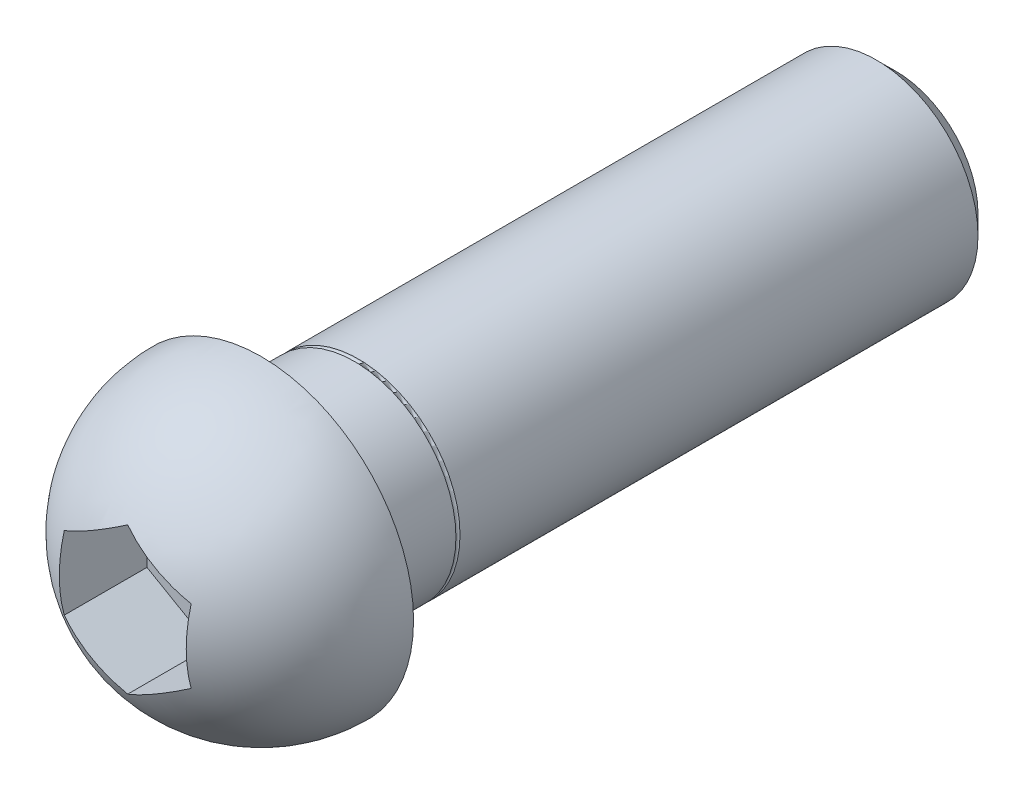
ISO-10303-21;
HEADER;
FILE_DESCRIPTION(('STEP AP214'),'2;1');
FILE_NAME('part.step','',(''),(''),'','','');
FILE_SCHEMA(('AUTOMOTIVE_DESIGN { 1 0 10303 214 1 1 1 1 }'));
ENDSEC;
DATA;
#1=APPLICATION_CONTEXT('core data for automotive mechanical design processes');
#2=APPLICATION_PROTOCOL_DEFINITION('international standard','automotive_design',2000,#1);
#3=PRODUCT_CONTEXT('',#1,'mechanical');
#4=PRODUCT('Part','Part','',(#3));
#5=PRODUCT_RELATED_PRODUCT_CATEGORY('part','',(#4));
#6=PRODUCT_DEFINITION_FORMATION('','',#4);
#7=PRODUCT_DEFINITION_CONTEXT('part definition',#1,'design');
#8=PRODUCT_DEFINITION('design','',#6,#7);
#9=PRODUCT_DEFINITION_SHAPE('','',#8);
#10=(LENGTH_UNIT() NAMED_UNIT(*) SI_UNIT(.MILLI.,.METRE.));
#11=(NAMED_UNIT(*) PLANE_ANGLE_UNIT() SI_UNIT($,.RADIAN.));
#12=(NAMED_UNIT(*) SI_UNIT($,.STERADIAN.) SOLID_ANGLE_UNIT());
#13=UNCERTAINTY_MEASURE_WITH_UNIT(LENGTH_MEASURE(1.E-05),#10,'distance_accuracy_value','');
#14=(GEOMETRIC_REPRESENTATION_CONTEXT(3) GLOBAL_UNCERTAINTY_ASSIGNED_CONTEXT((#13)) GLOBAL_UNIT_ASSIGNED_CONTEXT((#10,
#11,#12)) REPRESENTATION_CONTEXT('',''));
#15=CARTESIAN_POINT('',(0.,0.,0.));
#16=DIRECTION('',(0.,0.,1.));
#17=DIRECTION('',(1.,0.,0.));
#18=AXIS2_PLACEMENT_3D('',#15,#16,#17);
#19=CARTESIAN_POINT('',(0.,0.,8.5));
#20=DIRECTION('',(0.,0.,-1.));
#21=DIRECTION('',(-1.,0.,0.));
#22=AXIS2_PLACEMENT_3D('',#19,#20,#21);
#23=PLANE('',#22);
#24=DIRECTION('',(-0.866025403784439,0.5,0.));
#25=VECTOR('',#24,1.);
#26=CARTESIAN_POINT('',(2.5,1.44337567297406,8.5));
#27=LINE('',#26,#25);
#28=CARTESIAN_POINT('',(2.5,1.44337567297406,8.5));
#29=VERTEX_POINT('',#28);
#30=CARTESIAN_POINT('',(0.,2.88675134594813,8.5));
#31=VERTEX_POINT('',#30);
#32=EDGE_CURVE('E68',#29,#31,#27,.T.);
#33=ORIENTED_EDGE('',*,*,#32,.T.);
#34=DIRECTION('',(-0.866025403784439,-0.5,0.));
#35=VECTOR('',#34,1.);
#36=CARTESIAN_POINT('',(0.,2.88675134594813,8.5));
#37=LINE('',#36,#35);
#38=CARTESIAN_POINT('',(-2.5,1.44337567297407,8.5));
#39=VERTEX_POINT('',#38);
#40=EDGE_CURVE('E103',#31,#39,#37,.T.);
#41=ORIENTED_EDGE('',*,*,#40,.T.);
#42=DIRECTION('',(0.,1.,0.));
#43=VECTOR('',#42,1.);
#44=CARTESIAN_POINT('',(-2.5,1.44337567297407,8.5));
#45=LINE('',#44,#43);
#46=CARTESIAN_POINT('',(-2.5,-1.44337567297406,8.5));
#47=VERTEX_POINT('',#46);
#48=EDGE_CURVE('E109',#39,#47,#45,.F.);
#49=ORIENTED_EDGE('',*,*,#48,.T.);
#50=DIRECTION('',(0.866025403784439,-0.5,0.));
#51=VECTOR('',#50,1.);
#52=CARTESIAN_POINT('',(-2.5,-1.44337567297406,8.5));
#53=LINE('',#52,#51);
#54=CARTESIAN_POINT('',(0.,-2.88675134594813,8.5));
#55=VERTEX_POINT('',#54);
#56=EDGE_CURVE('E80',#47,#55,#53,.T.);
#57=ORIENTED_EDGE('',*,*,#56,.T.);
#58=DIRECTION('',(0.866025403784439,0.5,0.));
#59=VECTOR('',#58,1.);
#60=CARTESIAN_POINT('',(0.,-2.88675134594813,8.5));
#61=LINE('',#60,#59);
#62=CARTESIAN_POINT('',(2.5,-1.44337567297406,8.5));
#63=VERTEX_POINT('',#62);
#64=EDGE_CURVE('E82',#55,#63,#61,.T.);
#65=ORIENTED_EDGE('',*,*,#64,.T.);
#66=DIRECTION('',(0.,1.,0.));
#67=VECTOR('',#66,1.);
#68=CARTESIAN_POINT('',(2.5,0.,8.5));
#69=LINE('',#68,#67);
#70=EDGE_CURVE('E84',#63,#29,#69,.T.);
#71=ORIENTED_EDGE('',*,*,#70,.T.);
#72=EDGE_LOOP('',(#33,#41,#49,#57,#65,#71));
#73=FACE_BOUND('',#72,.T.);
#74=ADVANCED_FACE('F15',(#73),#23,.F.);
#75=CARTESIAN_POINT('',(2.5,0.,14.5));
#76=DIRECTION('',(1.,0.,0.));
#77=DIRECTION('',(0.,0.,-1.));
#78=AXIS2_PLACEMENT_3D('',#75,#76,#77);
#79=PLANE('',#78);
#80=DIRECTION('',(0.,0.,1.));
#81=VECTOR('',#80,1.);
#82=CARTESIAN_POINT('',(2.5,1.44337567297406,14.5));
#83=LINE('',#82,#81);
#84=CARTESIAN_POINT('',(2.5,1.44337567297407,11.7599112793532));
#85=VERTEX_POINT('',#84);
#86=EDGE_CURVE('E92',#85,#29,#83,.F.);
#87=ORIENTED_EDGE('',*,*,#86,.T.);
#88=ORIENTED_EDGE('',*,*,#70,.F.);
#89=DIRECTION('',(0.,0.,1.));
#90=VECTOR('',#89,1.);
#91=CARTESIAN_POINT('',(2.5,-1.44337567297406,14.5));
#92=LINE('',#91,#90);
#93=CARTESIAN_POINT('',(2.5,-1.44337567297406,11.7599112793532));
#94=VERTEX_POINT('',#93);
#95=EDGE_CURVE('E88',#63,#94,#92,.T.);
#96=ORIENTED_EDGE('',*,*,#95,.T.);
#97=CARTESIAN_POINT('',(2.5,0.,6.5));
#98=DIRECTION('',(1.,0.,0.));
#99=DIRECTION('',(0.,0.,-1.));
#100=AXIS2_PLACEMENT_3D('',#97,#98,#99);
#101=CIRCLE('',#100,5.45435605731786);
#102=EDGE_CURVE('E18',#85,#94,#101,.T.);
#103=ORIENTED_EDGE('',*,*,#102,.F.);
#104=EDGE_LOOP('',(#87,#88,#96,#103));
#105=FACE_BOUND('',#104,.T.);
#106=ADVANCED_FACE('F90',(#105),#79,.F.);
#107=CARTESIAN_POINT('',(0.,-2.88675134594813,14.5));
#108=DIRECTION('',(0.5,-0.866025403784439,0.));
#109=DIRECTION('',(0.866025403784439,0.5,0.));
#110=AXIS2_PLACEMENT_3D('',#107,#108,#109);
#111=PLANE('',#110);
#112=ORIENTED_EDGE('',*,*,#95,.F.);
#113=ORIENTED_EDGE('',*,*,#64,.F.);
#114=DIRECTION('',(0.,0.,1.));
#115=VECTOR('',#114,1.);
#116=CARTESIAN_POINT('',(0.,-2.88675134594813,14.5));
#117=LINE('',#116,#115);
#118=CARTESIAN_POINT('',(0.,-2.88675134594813,11.7599112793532));
#119=VERTEX_POINT('',#118);
#120=EDGE_CURVE('E98',#55,#119,#117,.T.);
#121=ORIENTED_EDGE('',*,*,#120,.T.);
#122=CARTESIAN_POINT('',(2.5,-1.44337567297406,11.7599112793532));
#123=CARTESIAN_POINT('',(2.37052455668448,-1.51812835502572,11.8009548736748));
#124=CARTESIAN_POINT('',(2.23952785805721,-1.59375933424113,11.8355910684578));
#125=CARTESIAN_POINT('',(1.97542390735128,-1.74623982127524,11.8918777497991));
#126=CARTESIAN_POINT('',(1.84231612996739,-1.82308963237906,11.9135249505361));
#127=CARTESIAN_POINT('',(1.57792949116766,-1.97573332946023,11.9433104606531));
#128=CARTESIAN_POINT('',(1.44667483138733,-2.0515132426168,11.95173553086));
#129=CARTESIAN_POINT('',(1.18406784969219,-2.20312945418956,11.9559318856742));
#130=CARTESIAN_POINT('',(1.05271558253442,-2.27896572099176,11.9517078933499));
#131=CARTESIAN_POINT('',(0.767059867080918,-2.44388912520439,11.9287241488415));
#132=CARTESIAN_POINT('',(0.612902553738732,-2.53289189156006,11.9074733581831));
#133=CARTESIAN_POINT('',(0.305108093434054,-2.71059710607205,11.8472041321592));
#134=CARTESIAN_POINT('',(0.151505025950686,-2.79927987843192,11.8079535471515));
#135=CARTESIAN_POINT('',(0.,-2.88675134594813,11.7599112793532));
#136=B_SPLINE_CURVE_WITH_KNOTS('',3,(#122,#123,#124,#125,#126,#127,#128,#129,#130,#131,#132,
#133,#134,#135),.UNSPECIFIED.,.F.,.F.,(4,2,2,2,2,2,4),(0.,0.464967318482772,0.930052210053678,
1.38490366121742,1.83958529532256,2.37651005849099,2.92056340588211),.UNSPECIFIED.);
#137=EDGE_CURVE('E96',#94,#119,#136,.T.);
#138=ORIENTED_EDGE('',*,*,#137,.F.);
#139=EDGE_LOOP('',(#112,#113,#121,#138));
#140=FACE_BOUND('',#139,.T.);
#141=ADVANCED_FACE('F94',(#140),#111,.F.);
#142=CARTESIAN_POINT('',(-2.5,-1.44337567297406,14.5));
#143=DIRECTION('',(-0.5,-0.866025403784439,0.));
#144=DIRECTION('',(0.866025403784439,-0.5,0.));
#145=AXIS2_PLACEMENT_3D('',#142,#143,#144);
#146=PLANE('',#145);
#147=ORIENTED_EDGE('',*,*,#120,.F.);
#148=ORIENTED_EDGE('',*,*,#56,.F.);
#149=DIRECTION('',(0.,0.,1.));
#150=VECTOR('',#149,1.);
#151=CARTESIAN_POINT('',(-2.5,-1.44337567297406,14.5));
#152=LINE('',#151,#150);
#153=CARTESIAN_POINT('',(-2.5,-1.44337567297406,11.7599112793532));
#154=VERTEX_POINT('',#153);
#155=EDGE_CURVE('E106',#47,#154,#152,.T.);
#156=ORIENTED_EDGE('',*,*,#155,.T.);
#157=CARTESIAN_POINT('',(0.,-2.88675134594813,11.7599112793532));
#158=CARTESIAN_POINT('',(-0.129475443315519,-2.81199866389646,11.8009548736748));
#159=CARTESIAN_POINT('',(-0.260472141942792,-2.73636768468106,11.8355910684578));
#160=CARTESIAN_POINT('',(-0.524576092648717,-2.58388719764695,11.8918777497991));
#161=CARTESIAN_POINT('',(-0.657683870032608,-2.50703738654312,11.9135249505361));
#162=CARTESIAN_POINT('',(-0.922070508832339,-2.35439368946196,11.9433104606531));
#163=CARTESIAN_POINT('',(-1.05332516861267,-2.27861377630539,11.95173553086));
#164=CARTESIAN_POINT('',(-1.3159321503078,-2.12699756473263,11.9559318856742));
#165=CARTESIAN_POINT('',(-1.44728441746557,-2.05116129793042,11.9517078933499));
#166=CARTESIAN_POINT('',(-1.73294013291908,-1.88623789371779,11.9287241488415));
#167=CARTESIAN_POINT('',(-1.88709744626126,-1.79723512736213,11.9074733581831));
#168=CARTESIAN_POINT('',(-2.19489190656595,-1.61952991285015,11.8472041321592));
#169=CARTESIAN_POINT('',(-2.34849497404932,-1.53084714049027,11.8079535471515));
#170=CARTESIAN_POINT('',(-2.5,-1.44337567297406,11.7599112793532));
#171=B_SPLINE_CURVE_WITH_KNOTS('',3,(#157,#158,#159,#160,#161,#162,#163,#164,#165,#166,#167,
#168,#169,#170),.UNSPECIFIED.,.F.,.F.,(4,2,2,2,2,2,4),(0.,0.464967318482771,0.930052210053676,
1.38490366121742,1.83958529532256,2.37651005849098,2.92056340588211),.UNSPECIFIED.);
#172=EDGE_CURVE('E159',#119,#154,#171,.T.);
#173=ORIENTED_EDGE('',*,*,#172,.F.);
#174=EDGE_LOOP('',(#147,#148,#156,#173));
#175=FACE_BOUND('',#174,.T.);
#176=ADVANCED_FACE('F157',(#175),#146,.F.);
#177=CARTESIAN_POINT('',(-2.5,1.44337567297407,14.5));
#178=DIRECTION('',(-1.,0.,0.));
#179=DIRECTION('',(0.,0.,1.));
#180=AXIS2_PLACEMENT_3D('',#177,#178,#179);
#181=PLANE('',#180);
#182=ORIENTED_EDGE('',*,*,#155,.F.);
#183=ORIENTED_EDGE('',*,*,#48,.F.);
#184=DIRECTION('',(0.,0.,1.));
#185=VECTOR('',#184,1.);
#186=CARTESIAN_POINT('',(-2.5,1.44337567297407,14.5));
#187=LINE('',#186,#185);
#188=CARTESIAN_POINT('',(-2.5,1.44337567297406,11.7599112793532));
#189=VERTEX_POINT('',#188);
#190=EDGE_CURVE('E105',#39,#189,#187,.T.);
#191=ORIENTED_EDGE('',*,*,#190,.T.);
#192=CARTESIAN_POINT('',(-2.5,0.,6.5));
#193=DIRECTION('',(1.,0.,0.));
#194=DIRECTION('',(0.,0.,-1.));
#195=AXIS2_PLACEMENT_3D('',#192,#193,#194);
#196=CIRCLE('',#195,5.45435605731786);
#197=EDGE_CURVE('E163',#154,#189,#196,.F.);
#198=ORIENTED_EDGE('',*,*,#197,.F.);
#199=EDGE_LOOP('',(#182,#183,#191,#198));
#200=FACE_BOUND('',#199,.T.);
#201=ADVANCED_FACE('F164',(#200),#181,.F.);
#202=CARTESIAN_POINT('',(0.,2.88675134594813,14.5));
#203=DIRECTION('',(-0.5,0.866025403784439,0.));
#204=DIRECTION('',(-0.866025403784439,-0.5,0.));
#205=AXIS2_PLACEMENT_3D('',#202,#203,#204);
#206=PLANE('',#205);
#207=ORIENTED_EDGE('',*,*,#190,.F.);
#208=ORIENTED_EDGE('',*,*,#40,.F.);
#209=DIRECTION('',(0.,0.,1.));
#210=VECTOR('',#209,1.);
#211=CARTESIAN_POINT('',(0.,2.88675134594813,14.5));
#212=LINE('',#211,#210);
#213=CARTESIAN_POINT('',(0.,2.88675134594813,11.7599112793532));
#214=VERTEX_POINT('',#213);
#215=EDGE_CURVE('E107',#31,#214,#212,.T.);
#216=ORIENTED_EDGE('',*,*,#215,.T.);
#217=CARTESIAN_POINT('',(-2.5,1.44337567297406,11.7599112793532));
#218=CARTESIAN_POINT('',(-2.37052455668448,1.51812835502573,11.8009548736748));
#219=CARTESIAN_POINT('',(-2.2395278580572,1.59375933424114,11.8355910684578));
#220=CARTESIAN_POINT('',(-1.97542390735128,1.74623982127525,11.8918777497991));
#221=CARTESIAN_POINT('',(-1.84231612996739,1.82308963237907,11.9135249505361));
#222=CARTESIAN_POINT('',(-1.57792949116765,1.97573332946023,11.9433104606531));
#223=CARTESIAN_POINT('',(-1.44667483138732,2.0515132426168,11.95173553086));
#224=CARTESIAN_POINT('',(-1.18406784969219,2.20312945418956,11.9559318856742));
#225=CARTESIAN_POINT('',(-1.05271558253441,2.27896572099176,11.9517078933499));
#226=CARTESIAN_POINT('',(-0.767059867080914,2.4438891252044,11.9287241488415));
#227=CARTESIAN_POINT('',(-0.612902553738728,2.53289189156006,11.9074733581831));
#228=CARTESIAN_POINT('',(-0.30510809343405,2.71059710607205,11.8472041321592));
#229=CARTESIAN_POINT('',(-0.151505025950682,2.79927987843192,11.8079535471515));
#230=CARTESIAN_POINT('',(0.,2.88675134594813,11.7599112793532));
#231=B_SPLINE_CURVE_WITH_KNOTS('',3,(#217,#218,#219,#220,#221,#222,#223,#224,#225,#226,#227,
#228,#229,#230),.UNSPECIFIED.,.F.,.F.,(4,2,2,2,2,2,4),(0.,0.464967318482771,0.930052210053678,
1.38490366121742,1.83958529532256,2.37651005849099,2.92056340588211),.UNSPECIFIED.);
#232=EDGE_CURVE('E169',#189,#214,#231,.T.);
#233=ORIENTED_EDGE('',*,*,#232,.F.);
#234=EDGE_LOOP('',(#207,#208,#216,#233));
#235=FACE_BOUND('',#234,.T.);
#236=ADVANCED_FACE('F291',(#235),#206,.F.);
#237=CARTESIAN_POINT('',(2.5,1.44337567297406,14.5));
#238=DIRECTION('',(0.5,0.866025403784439,0.));
#239=DIRECTION('',(-0.866025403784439,0.5,0.));
#240=AXIS2_PLACEMENT_3D('',#237,#238,#239);
#241=PLANE('',#240);
#242=ORIENTED_EDGE('',*,*,#215,.F.);
#243=ORIENTED_EDGE('',*,*,#32,.F.);
#244=ORIENTED_EDGE('',*,*,#86,.F.);
#245=CARTESIAN_POINT('',(0.,2.88675134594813,11.7599112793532));
#246=CARTESIAN_POINT('',(0.129475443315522,2.81199866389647,11.8009548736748));
#247=CARTESIAN_POINT('',(0.260472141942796,2.73636768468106,11.8355910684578));
#248=CARTESIAN_POINT('',(0.524576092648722,2.58388719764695,11.8918777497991));
#249=CARTESIAN_POINT('',(0.657683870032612,2.50703738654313,11.9135249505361));
#250=CARTESIAN_POINT('',(0.922070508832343,2.35439368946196,11.9433104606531));
#251=CARTESIAN_POINT('',(1.05332516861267,2.2786137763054,11.95173553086));
#252=CARTESIAN_POINT('',(1.31593215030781,2.12699756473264,11.9559318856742));
#253=CARTESIAN_POINT('',(1.44728441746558,2.05116129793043,11.9517078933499));
#254=CARTESIAN_POINT('',(1.73294013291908,1.8862378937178,11.9287241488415));
#255=CARTESIAN_POINT('',(1.88709744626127,1.79723512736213,11.9074733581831));
#256=CARTESIAN_POINT('',(2.19489190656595,1.61952991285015,11.8472041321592));
#257=CARTESIAN_POINT('',(2.34849497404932,1.53084714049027,11.8079535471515));
#258=CARTESIAN_POINT('',(2.5,1.44337567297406,11.7599112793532));
#259=B_SPLINE_CURVE_WITH_KNOTS('',3,(#245,#246,#247,#248,#249,#250,#251,#252,#253,#254,#255,
#256,#257,#258),.UNSPECIFIED.,.F.,.F.,(4,2,2,2,2,2,4),(0.,0.464967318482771,0.930052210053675,
1.38490366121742,1.83958529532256,2.37651005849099,2.92056340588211),.UNSPECIFIED.);
#260=EDGE_CURVE('E127',#214,#85,#259,.T.);
#261=ORIENTED_EDGE('',*,*,#260,.F.);
#262=EDGE_LOOP('',(#242,#243,#244,#261));
#263=FACE_BOUND('',#262,.T.);
#264=ADVANCED_FACE('F140',(#263),#241,.F.);
#265=CARTESIAN_POINT('',(0.,0.,6.5));
#266=DIRECTION('',(1.,0.,0.));
#267=DIRECTION('',(0.,-1.,0.));
#268=AXIS2_PLACEMENT_3D('',#265,#266,#267);
#269=SPHERICAL_SURFACE('',#268,6.);
#270=CARTESIAN_POINT('',(0.,0.,6.5));
#271=DIRECTION('',(0.,0.,-1.));
#272=DIRECTION('',(1.,0.,0.));
#273=AXIS2_PLACEMENT_3D('',#270,#271,#272);
#274=CIRCLE('',#273,6.);
#275=CARTESIAN_POINT('',(6.,0.,6.5));
#276=VERTEX_POINT('',#275);
#277=CARTESIAN_POINT('',(-6.,0.,6.5));
#278=VERTEX_POINT('',#277);
#279=EDGE_CURVE('E117',#276,#278,#274,.T.);
#280=ORIENTED_EDGE('',*,*,#279,.F.);
#281=CARTESIAN_POINT('',(0.,6.,6.5));
#282=CARTESIAN_POINT('',(0.168756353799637,6.00001814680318,6.5));
#283=CARTESIAN_POINT('',(0.337510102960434,5.99288108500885,6.5));
#284=CARTESIAN_POINT('',(0.673810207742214,5.9644276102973,6.5));
#285=CARTESIAN_POINT('',(0.841356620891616,5.94311187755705,6.5));
#286=CARTESIAN_POINT('',(1.17393059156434,5.88645351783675,6.5));
#287=CARTESIAN_POINT('',(1.33895995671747,5.85112150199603,6.5));
#288=CARTESIAN_POINT('',(1.66545542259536,5.7666875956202,6.5));
#289=CARTESIAN_POINT('',(1.82692156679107,5.71758587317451,6.5));
#290=CARTESIAN_POINT('',(2.14519377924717,5.60594271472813,6.5));
#291=CARTESIAN_POINT('',(2.3019984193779,5.54339720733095,6.5));
#292=CARTESIAN_POINT('',(2.60983870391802,5.40529477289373,6.5));
#293=CARTESIAN_POINT('',(2.76087220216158,5.32973306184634,6.5));
#294=CARTESIAN_POINT('',(3.05595586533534,5.16619525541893,6.5));
#295=CARTESIAN_POINT('',(3.20000971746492,5.07822581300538,6.5));
#296=CARTESIAN_POINT('',(3.48024558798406,4.89043453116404,6.5));
#297=CARTESIAN_POINT('',(3.61642485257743,4.7906085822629,6.5));
#298=CARTESIAN_POINT('',(3.87986471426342,4.57985793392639,6.5));
#299=CARTESIAN_POINT('',(4.00712694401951,4.46893527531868,6.5));
#300=CARTESIAN_POINT('',(4.25185565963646,4.23676437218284,6.5));
#301=CARTESIAN_POINT('',(4.36932214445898,4.11551612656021,6.5));
#302=CARTESIAN_POINT('',(4.59366588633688,3.86350922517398,6.5));
#303=CARTESIAN_POINT('',(4.70053921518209,3.73274707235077,6.5));
#304=CARTESIAN_POINT('',(4.90285191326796,3.46272920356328,6.5));
#305=CARTESIAN_POINT('',(4.99829523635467,3.32347644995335,6.5));
#306=CARTESIAN_POINT('',(5.17716195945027,3.03734667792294,6.5));
#307=CARTESIAN_POINT('',(5.26057870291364,2.890465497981,6.5));
#308=CARTESIAN_POINT('',(5.41470773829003,2.59025155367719,6.5));
#309=CARTESIAN_POINT('',(5.48542463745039,2.43692115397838,6.5));
#310=CARTESIAN_POINT('',(5.61367072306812,2.12488574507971,6.5));
#311=CARTESIAN_POINT('',(5.6712036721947,1.96618228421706,6.5));
#312=CARTESIAN_POINT('',(5.77268420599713,1.64455589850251,6.5));
#313=CARTESIAN_POINT('',(5.81663505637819,1.48163399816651,6.5));
#314=CARTESIAN_POINT('',(5.90226151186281,1.10104415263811,6.5));
#315=CARTESIAN_POINT('',(5.93891223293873,0.882212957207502,6.5));
#316=CARTESIAN_POINT('',(5.97556061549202,0.552208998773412,6.5));
#317=CARTESIAN_POINT('',(5.98472211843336,0.441970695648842,6.5));
#318=CARTESIAN_POINT('',(5.99694105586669,0.221163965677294,6.5));
#319=CARTESIAN_POINT('',(5.99999891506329,0.11059556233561,6.5));
#320=CARTESIAN_POINT('',(6.,0.,6.5));
#321=B_SPLINE_CURVE_WITH_KNOTS('',3,(#281,#282,#283,#284,#285,#286,#287,#288,#289,#290,#291,
#292,#293,#294,#295,#296,#297,#298,#299,#300,#301,#302,#303,#304,#305,#306,#307,#308,#309,#310,
#311,#312,#313,#314,#315,#316,#317,#318,#319,#320),.UNSPECIFIED.,.F.,.F.,(4,2,2,2,2,2,2,2,2,2,2,
2,2,2,2,2,2,2,2,4),(0.,0.50611453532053,1.01220479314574,1.51791264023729,2.02361431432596,
2.52946935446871,3.03551071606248,3.54128176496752,4.04722862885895,4.55308261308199,
5.05893665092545,5.56497757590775,6.07084294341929,6.57698723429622,7.08294753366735,
7.58876325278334,8.09445725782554,8.75855077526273,9.09026407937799,9.42195430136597),.UNSPECIFIED.);
#322=CARTESIAN_POINT('',(0.,6.,6.5));
#323=VERTEX_POINT('',#322);
#324=EDGE_CURVE('E119',#323,#276,#321,.T.);
#325=ORIENTED_EDGE('',*,*,#324,.F.);
#326=CARTESIAN_POINT('',(0.,0.,6.5));
#327=DIRECTION('',(0.,0.,-1.));
#328=DIRECTION('',(1.,0.,0.));
#329=AXIS2_PLACEMENT_3D('',#326,#327,#328);
#330=CIRCLE('',#329,6.);
#331=EDGE_CURVE('E33',#278,#323,#330,.T.);
#332=ORIENTED_EDGE('',*,*,#331,.F.);
#333=EDGE_LOOP('',(#280,#325,#332));
#334=FACE_BOUND('',#333,.T.);
#335=ORIENTED_EDGE('',*,*,#232,.T.);
#336=ORIENTED_EDGE('',*,*,#260,.T.);
#337=ORIENTED_EDGE('',*,*,#102,.T.);
#338=ORIENTED_EDGE('',*,*,#137,.T.);
#339=ORIENTED_EDGE('',*,*,#172,.T.);
#340=ORIENTED_EDGE('',*,*,#197,.T.);
#341=EDGE_LOOP('',(#335,#336,#337,#338,#339,#340));
#342=FACE_BOUND('',#341,.T.);
#343=ADVANCED_FACE('F136',(#334,#342),#269,.T.);
#344=CARTESIAN_POINT('',(0.,0.,6.5));
#345=DIRECTION('',(0.,0.,-1.));
#346=DIRECTION('',(-1.,0.,0.));
#347=AXIS2_PLACEMENT_3D('',#344,#345,#346);
#348=PLANE('',#347);
#349=CARTESIAN_POINT('',(0.,0.,6.5));
#350=DIRECTION('',(0.,0.,-1.));
#351=DIRECTION('',(1.,0.,0.));
#352=AXIS2_PLACEMENT_3D('',#349,#350,#351);
#353=CIRCLE('',#352,4.4);
#354=CARTESIAN_POINT('',(4.4,0.,6.5));
#355=VERTEX_POINT('',#354);
#356=EDGE_CURVE('E116',#355,#355,#353,.F.);
#357=ORIENTED_EDGE('',*,*,#356,.T.);
#358=EDGE_LOOP('',(#357));
#359=FACE_BOUND('',#358,.T.);
#360=ORIENTED_EDGE('',*,*,#331,.T.);
#361=ORIENTED_EDGE('',*,*,#324,.T.);
#362=ORIENTED_EDGE('',*,*,#279,.T.);
#363=EDGE_LOOP('',(#360,#361,#362));
#364=FACE_BOUND('',#363,.T.);
#365=ADVANCED_FACE('F133',(#359,#364),#348,.T.);
#366=CARTESIAN_POINT('',(0.,0.,6.1));
#367=DIRECTION('',(0.,0.,-1.));
#368=DIRECTION('',(1.,0.,0.));
#369=AXIS2_PLACEMENT_3D('',#366,#367,#368);
#370=TOROIDAL_SURFACE('',#369,4.4,0.4);
#371=ORIENTED_EDGE('',*,*,#356,.F.);
#372=EDGE_LOOP('',(#371));
#373=FACE_BOUND('',#372,.T.);
#374=CARTESIAN_POINT('',(0.,0.,6.1));
#375=DIRECTION('',(0.,0.,-1.));
#376=DIRECTION('',(-1.,0.,0.));
#377=AXIS2_PLACEMENT_3D('',#374,#375,#376);
#378=CIRCLE('',#377,4.);
#379=CARTESIAN_POINT('',(-4.,0.,6.1));
#380=VERTEX_POINT('',#379);
#381=EDGE_CURVE('E216',#380,#380,#378,.T.);
#382=ORIENTED_EDGE('',*,*,#381,.F.);
#383=EDGE_LOOP('',(#382));
#384=FACE_BOUND('',#383,.T.);
#385=ADVANCED_FACE('F227',(#373,#384),#370,.F.);
#386=CARTESIAN_POINT('',(0.,0.,-5.6166));
#387=DIRECTION('',(0.,0.,-1.));
#388=DIRECTION('',(-1.,0.,0.));
#389=AXIS2_PLACEMENT_3D('',#386,#387,#388);
#390=CYLINDRICAL_SURFACE('',#389,4.);
#391=CARTESIAN_POINT('',(0.,0.,2.83));
#392=DIRECTION('',(0.,0.,-1.));
#393=DIRECTION('',(1.,0.,0.));
#394=AXIS2_PLACEMENT_3D('',#391,#392,#393);
#395=CIRCLE('',#394,4.);
#396=CARTESIAN_POINT('',(4.,0.,2.83));
#397=VERTEX_POINT('',#396);
#398=EDGE_CURVE('E114',#397,#397,#395,.F.);
#399=ORIENTED_EDGE('',*,*,#398,.T.);
#400=EDGE_LOOP('',(#399));
#401=FACE_BOUND('',#400,.T.);
#402=ORIENTED_EDGE('',*,*,#381,.T.);
#403=EDGE_LOOP('',(#402));
#404=FACE_BOUND('',#403,.T.);
#405=ADVANCED_FACE('F230',(#401,#404),#390,.T.);
#406=CARTESIAN_POINT('',(0.,0.,-18.5));
#407=DIRECTION('',(0.,0.,1.));
#408=DIRECTION('',(1.,0.,0.));
#409=AXIS2_PLACEMENT_3D('',#406,#407,#408);
#410=PLANE('',#409);
#411=CARTESIAN_POINT('',(0.,0.,-18.4999999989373));
#412=DIRECTION('',(0.,0.,1.));
#413=DIRECTION('',(1.,0.,0.));
#414=AXIS2_PLACEMENT_3D('',#411,#412,#413);
#415=CIRCLE('',#414,3.23319999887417);
#416=CARTESIAN_POINT('',(3.23319999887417,0.,-18.4999999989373));
#417=VERTEX_POINT('',#416);
#418=EDGE_CURVE('E111',#417,#417,#415,.T.);
#419=ORIENTED_EDGE('',*,*,#418,.F.);
#420=EDGE_LOOP('',(#419));
#421=FACE_BOUND('',#420,.T.);
#422=ADVANCED_FACE('F206',(#421),#410,.F.);
#423=CARTESIAN_POINT('',(0.,0.,2.75));
#424=DIRECTION('',(0.,0.,-1.));
#425=DIRECTION('',(1.,0.,0.));
#426=AXIS2_PLACEMENT_3D('',#423,#424,#425);
#427=TOROIDAL_SURFACE('',#426,4.,0.08);
#428=ORIENTED_EDGE('',*,*,#398,.F.);
#429=EDGE_LOOP('',(#428));
#430=FACE_BOUND('',#429,.T.);
#431=CARTESIAN_POINT('',(0.,0.,2.67));
#432=DIRECTION('',(0.,0.,-1.));
#433=DIRECTION('',(-1.,0.,0.));
#434=AXIS2_PLACEMENT_3D('',#431,#432,#433);
#435=CIRCLE('',#434,4.);
#436=CARTESIAN_POINT('',(-4.,0.,2.67));
#437=VERTEX_POINT('',#436);
#438=EDGE_CURVE('E24',#437,#437,#435,.T.);
#439=ORIENTED_EDGE('',*,*,#438,.F.);
#440=EDGE_LOOP('',(#439));
#441=FACE_BOUND('',#440,.T.);
#442=ADVANCED_FACE('F198',(#430,#441),#427,.F.);
#443=CARTESIAN_POINT('',(0.,0.,-17.7331999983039));
#444=DIRECTION('',(0.,0.,1.));
#445=DIRECTION('',(1.,0.,0.));
#446=AXIS2_PLACEMENT_3D('',#443,#444,#445);
#447=CONICAL_SURFACE('',#446,3.99999999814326,0.78539816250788);
#448=CARTESIAN_POINT('',(0.,0.,-17.7332));
#449=DIRECTION('',(0.,0.,-1.));
#450=DIRECTION('',(-1.,0.,0.));
#451=AXIS2_PLACEMENT_3D('',#448,#449,#450);
#452=CIRCLE('',#451,4.);
#453=CARTESIAN_POINT('',(-4.,0.,-17.7332));
#454=VERTEX_POINT('',#453);
#455=EDGE_CURVE('E10',#454,#454,#452,.F.);
#456=ORIENTED_EDGE('',*,*,#455,.F.);
#457=EDGE_LOOP('',(#456));
#458=FACE_BOUND('',#457,.T.);
#459=ORIENTED_EDGE('',*,*,#418,.T.);
#460=EDGE_LOOP('',(#459));
#461=FACE_BOUND('',#460,.T.);
#462=ADVANCED_FACE('F192',(#458,#461),#447,.T.);
#463=CARTESIAN_POINT('',(0.,0.,-5.6166));
#464=DIRECTION('',(0.,0.,-1.));
#465=DIRECTION('',(-1.,0.,0.));
#466=AXIS2_PLACEMENT_3D('',#463,#464,#465);
#467=CYLINDRICAL_SURFACE('',#466,4.);
#468=ORIENTED_EDGE('',*,*,#455,.T.);
#469=EDGE_LOOP('',(#468));
#470=FACE_BOUND('',#469,.T.);
#471=ORIENTED_EDGE('',*,*,#438,.T.);
#472=EDGE_LOOP('',(#471));
#473=FACE_BOUND('',#472,.T.);
#474=ADVANCED_FACE('F190',(#470,#473),#467,.T.);
#475=CLOSED_SHELL('',(#74,#106,#141,#176,#201,#236,#264,#343,#365,#385,#405,#422,#442,#462,#474));
#476=MANIFOLD_SOLID_BREP('B1',#475);
#477=ADVANCED_BREP_SHAPE_REPRESENTATION('',(#18,#476),#14);
#478=SHAPE_DEFINITION_REPRESENTATION(#9,#477);
ENDSEC;
END-ISO-10303-21;
